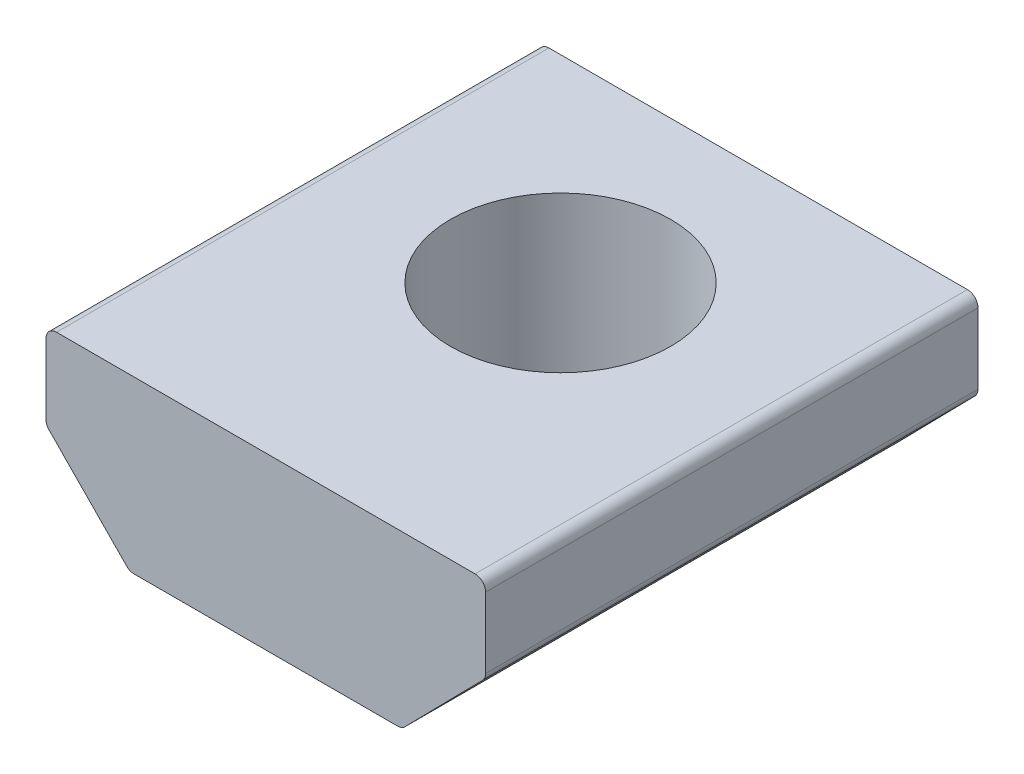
ISO-10303-21;
HEADER;
FILE_DESCRIPTION(('STEP AP214'),'2;1');
FILE_NAME('part.step','',(''),(''),'','','');
FILE_SCHEMA(('AUTOMOTIVE_DESIGN { 1 0 10303 214 1 1 1 1 }'));
ENDSEC;
DATA;
#1=APPLICATION_CONTEXT('core data for automotive mechanical design processes');
#2=APPLICATION_PROTOCOL_DEFINITION('international standard','automotive_design',2000,#1);
#3=PRODUCT_CONTEXT('',#1,'mechanical');
#4=PRODUCT('Part','Part','',(#3));
#5=PRODUCT_RELATED_PRODUCT_CATEGORY('part','',(#4));
#6=PRODUCT_DEFINITION_FORMATION('','',#4);
#7=PRODUCT_DEFINITION_CONTEXT('part definition',#1,'design');
#8=PRODUCT_DEFINITION('design','',#6,#7);
#9=PRODUCT_DEFINITION_SHAPE('','',#8);
#10=(LENGTH_UNIT() NAMED_UNIT(*) SI_UNIT(.MILLI.,.METRE.));
#11=(NAMED_UNIT(*) PLANE_ANGLE_UNIT() SI_UNIT($,.RADIAN.));
#12=(NAMED_UNIT(*) SI_UNIT($,.STERADIAN.) SOLID_ANGLE_UNIT());
#13=UNCERTAINTY_MEASURE_WITH_UNIT(LENGTH_MEASURE(1.E-05),#10,'distance_accuracy_value','');
#14=(GEOMETRIC_REPRESENTATION_CONTEXT(3) GLOBAL_UNCERTAINTY_ASSIGNED_CONTEXT((#13)) GLOBAL_UNIT_ASSIGNED_CONTEXT((#10,
#11,#12)) REPRESENTATION_CONTEXT('',''));
#15=CARTESIAN_POINT('',(0.,0.,0.));
#16=DIRECTION('',(0.,0.,1.));
#17=DIRECTION('',(1.,0.,0.));
#18=AXIS2_PLACEMENT_3D('',#15,#16,#17);
#19=CARTESIAN_POINT('',(-4.75499043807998,-5.77849999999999,17.78));
#20=DIRECTION('',(0.,0.,-1.));
#21=DIRECTION('',(-1.,0.,0.));
#22=AXIS2_PLACEMENT_3D('',#19,#20,#21);
#23=CYLINDRICAL_SURFACE('',#22,0.380999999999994);
#24=CARTESIAN_POINT('',(-4.75499043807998,-5.77849999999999,0.));
#25=DIRECTION('',(0.,0.,1.));
#26=DIRECTION('',(1.,0.,0.));
#27=AXIS2_PLACEMENT_3D('',#24,#25,#26);
#28=CIRCLE('',#27,0.380999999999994);
#29=CARTESIAN_POINT('',(-5.02690926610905,-6.04537291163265,0.));
#30=VERTEX_POINT('',#29);
#31=CARTESIAN_POINT('',(-4.75499043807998,-6.15949999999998,0.));
#32=VERTEX_POINT('',#31);
#33=EDGE_CURVE('E152',#30,#32,#28,.T.);
#34=ORIENTED_EDGE('',*,*,#33,.T.);
#35=DIRECTION('',(0.,0.,-1.));
#36=VECTOR('',#35,1.);
#37=CARTESIAN_POINT('',(-4.75499043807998,-6.15949999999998,17.78));
#38=LINE('',#37,#36);
#39=CARTESIAN_POINT('',(-4.75499043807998,-6.15949999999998,17.78));
#40=VERTEX_POINT('',#39);
#41=EDGE_CURVE('E11',#40,#32,#38,.T.);
#42=ORIENTED_EDGE('',*,*,#41,.F.);
#43=CARTESIAN_POINT('',(-4.75499043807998,-5.77849999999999,17.78));
#44=DIRECTION('',(0.,0.,1.));
#45=DIRECTION('',(1.,0.,0.));
#46=AXIS2_PLACEMENT_3D('',#43,#44,#45);
#47=CIRCLE('',#46,0.380999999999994);
#48=CARTESIAN_POINT('',(-5.02690926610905,-6.04537291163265,17.78));
#49=VERTEX_POINT('',#48);
#50=EDGE_CURVE('E175',#49,#40,#47,.T.);
#51=ORIENTED_EDGE('',*,*,#50,.F.);
#52=DIRECTION('',(0.,0.,-1.));
#53=VECTOR('',#52,1.);
#54=CARTESIAN_POINT('',(-5.02690926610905,-6.04537291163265,17.78));
#55=LINE('',#54,#53);
#56=EDGE_CURVE('E148',#49,#30,#55,.T.);
#57=ORIENTED_EDGE('',*,*,#56,.T.);
#58=EDGE_LOOP('',(#34,#42,#51,#57));
#59=FACE_BOUND('',#58,.T.);
#60=ADVANCED_FACE('F32',(#59),#23,.T.);
#61=CARTESIAN_POINT('',(-4.75499043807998,-6.15949999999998,17.78));
#62=DIRECTION('',(0.,1.,0.));
#63=DIRECTION('',(0.,0.,1.));
#64=AXIS2_PLACEMENT_3D('',#61,#62,#63);
#65=PLANE('',#64);
#66=CARTESIAN_POINT('',(0.,-6.15950000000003,7.1374));
#67=DIRECTION('',(0.,1.,0.));
#68=DIRECTION('',(-1.,0.,0.));
#69=AXIS2_PLACEMENT_3D('',#66,#67,#68);
#70=CIRCLE('',#69,3.97510000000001);
#71=CARTESIAN_POINT('',(-3.97509999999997,-6.15950000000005,7.1374));
#72=VERTEX_POINT('',#71);
#73=EDGE_CURVE('E156',#72,#72,#70,.T.);
#74=ORIENTED_EDGE('',*,*,#73,.T.);
#75=EDGE_LOOP('',(#74));
#76=FACE_BOUND('',#75,.T.);
#77=DIRECTION('',(1.,0.,0.));
#78=VECTOR('',#77,1.);
#79=CARTESIAN_POINT('',(-4.75499043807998,-6.15949999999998,0.));
#80=LINE('',#79,#78);
#81=CARTESIAN_POINT('',(4.75499043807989,-6.15949999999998,0.));
#82=VERTEX_POINT('',#81);
#83=EDGE_CURVE('E155',#32,#82,#80,.T.);
#84=ORIENTED_EDGE('',*,*,#83,.T.);
#85=DIRECTION('',(0.,0.,-1.));
#86=VECTOR('',#85,1.);
#87=CARTESIAN_POINT('',(4.75499043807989,-6.15949999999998,17.78));
#88=LINE('',#87,#86);
#89=CARTESIAN_POINT('',(4.75499043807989,-6.15949999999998,17.78));
#90=VERTEX_POINT('',#89);
#91=EDGE_CURVE('E40',#90,#82,#88,.T.);
#92=ORIENTED_EDGE('',*,*,#91,.F.);
#93=DIRECTION('',(1.,0.,0.));
#94=VECTOR('',#93,1.);
#95=CARTESIAN_POINT('',(-4.75499043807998,-6.15949999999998,17.78));
#96=LINE('',#95,#94);
#97=EDGE_CURVE('E103',#40,#90,#96,.T.);
#98=ORIENTED_EDGE('',*,*,#97,.F.);
#99=ORIENTED_EDGE('',*,*,#41,.T.);
#100=EDGE_LOOP('',(#84,#92,#98,#99));
#101=FACE_BOUND('',#100,.T.);
#102=ADVANCED_FACE('F253',(#76,#101),#65,.F.);
#103=CARTESIAN_POINT('',(4.75499043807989,-5.77849999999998,17.78));
#104=DIRECTION('',(0.,0.,-1.));
#105=DIRECTION('',(-1.,0.,0.));
#106=AXIS2_PLACEMENT_3D('',#103,#104,#105);
#107=CYLINDRICAL_SURFACE('',#106,0.381000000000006);
#108=CARTESIAN_POINT('',(4.75499043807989,-5.77849999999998,0.));
#109=DIRECTION('',(0.,0.,1.));
#110=DIRECTION('',(1.,0.,0.));
#111=AXIS2_PLACEMENT_3D('',#108,#109,#110);
#112=CIRCLE('',#111,0.381000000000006);
#113=CARTESIAN_POINT('',(5.02690926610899,-6.04537291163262,0.));
#114=VERTEX_POINT('',#113);
#115=EDGE_CURVE('E158',#82,#114,#112,.T.);
#116=ORIENTED_EDGE('',*,*,#115,.T.);
#117=DIRECTION('',(0.,0.,-1.));
#118=VECTOR('',#117,1.);
#119=CARTESIAN_POINT('',(5.02690926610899,-6.04537291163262,17.78));
#120=LINE('',#119,#118);
#121=CARTESIAN_POINT('',(5.02690926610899,-6.04537291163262,17.78));
#122=VERTEX_POINT('',#121);
#123=EDGE_CURVE('E194',#122,#114,#120,.T.);
#124=ORIENTED_EDGE('',*,*,#123,.F.);
#125=CARTESIAN_POINT('',(4.75499043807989,-5.77849999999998,17.78));
#126=DIRECTION('',(0.,0.,1.));
#127=DIRECTION('',(1.,0.,0.));
#128=AXIS2_PLACEMENT_3D('',#125,#126,#127);
#129=CIRCLE('',#128,0.381000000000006);
#130=EDGE_CURVE('E202',#90,#122,#129,.T.);
#131=ORIENTED_EDGE('',*,*,#130,.F.);
#132=ORIENTED_EDGE('',*,*,#91,.T.);
#133=EDGE_LOOP('',(#116,#124,#131,#132));
#134=FACE_BOUND('',#133,.T.);
#135=ADVANCED_FACE('F200',(#134),#107,.T.);
#136=CARTESIAN_POINT('',(5.02690926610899,-6.04537291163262,17.78));
#137=DIRECTION('',(-0.713697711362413,0.700453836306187,0.));
#138=DIRECTION('',(-0.700453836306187,-0.713697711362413,0.));
#139=AXIS2_PLACEMENT_3D('',#136,#137,#138);
#140=PLANE('',#139);
#141=DIRECTION('',(0.700453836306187,0.713697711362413,0.));
#142=VECTOR('',#141,1.);
#143=CARTESIAN_POINT('',(5.02690926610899,-6.04537291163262,0.));
#144=LINE('',#143,#142);
#145=CARTESIAN_POINT('',(7.82841882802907,-3.19089363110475,0.));
#146=VERTEX_POINT('',#145);
#147=EDGE_CURVE('E160',#114,#146,#144,.T.);
#148=ORIENTED_EDGE('',*,*,#147,.T.);
#149=DIRECTION('',(0.,0.,-1.));
#150=VECTOR('',#149,1.);
#151=CARTESIAN_POINT('',(7.82841882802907,-3.19089363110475,17.78));
#152=LINE('',#151,#150);
#153=CARTESIAN_POINT('',(7.82841882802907,-3.19089363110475,17.78));
#154=VERTEX_POINT('',#153);
#155=EDGE_CURVE('E191',#154,#146,#152,.T.);
#156=ORIENTED_EDGE('',*,*,#155,.F.);
#157=DIRECTION('',(0.700453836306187,0.713697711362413,0.));
#158=VECTOR('',#157,1.);
#159=CARTESIAN_POINT('',(5.02690926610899,-6.04537291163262,17.78));
#160=LINE('',#159,#158);
#161=EDGE_CURVE('E220',#122,#154,#160,.T.);
#162=ORIENTED_EDGE('',*,*,#161,.F.);
#163=ORIENTED_EDGE('',*,*,#123,.T.);
#164=EDGE_LOOP('',(#148,#156,#162,#163));
#165=FACE_BOUND('',#164,.T.);
#166=ADVANCED_FACE('F211',(#165),#140,.F.);
#167=CARTESIAN_POINT('',(7.55649999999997,-2.92402071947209,17.78));
#168=DIRECTION('',(0.,0.,-1.));
#169=DIRECTION('',(-1.,0.,0.));
#170=AXIS2_PLACEMENT_3D('',#167,#168,#169);
#171=CYLINDRICAL_SURFACE('',#170,0.381000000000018);
#172=CARTESIAN_POINT('',(7.55649999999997,-2.92402071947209,0.));
#173=DIRECTION('',(0.,0.,1.));
#174=DIRECTION('',(1.,0.,0.));
#175=AXIS2_PLACEMENT_3D('',#172,#173,#174);
#176=CIRCLE('',#175,0.381000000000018);
#177=CARTESIAN_POINT('',(7.93749999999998,-2.92402071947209,0.));
#178=VERTEX_POINT('',#177);
#179=EDGE_CURVE('E162',#146,#178,#176,.T.);
#180=ORIENTED_EDGE('',*,*,#179,.T.);
#181=DIRECTION('',(0.,0.,-1.));
#182=VECTOR('',#181,1.);
#183=CARTESIAN_POINT('',(7.93749999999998,-2.92402071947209,17.78));
#184=LINE('',#183,#182);
#185=CARTESIAN_POINT('',(7.93749999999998,-2.92402071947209,17.78));
#186=VERTEX_POINT('',#185);
#187=EDGE_CURVE('E188',#186,#178,#184,.T.);
#188=ORIENTED_EDGE('',*,*,#187,.F.);
#189=CARTESIAN_POINT('',(7.55649999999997,-2.92402071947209,17.78));
#190=DIRECTION('',(0.,0.,1.));
#191=DIRECTION('',(1.,0.,0.));
#192=AXIS2_PLACEMENT_3D('',#189,#190,#191);
#193=CIRCLE('',#192,0.381000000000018);
#194=EDGE_CURVE('E217',#154,#186,#193,.T.);
#195=ORIENTED_EDGE('',*,*,#194,.F.);
#196=ORIENTED_EDGE('',*,*,#155,.T.);
#197=EDGE_LOOP('',(#180,#188,#195,#196));
#198=FACE_BOUND('',#197,.T.);
#199=ADVANCED_FACE('F215',(#198),#171,.T.);
#200=CARTESIAN_POINT('',(7.93749999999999,-0.380999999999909,17.78));
#201=DIRECTION('',(-1.,0.,0.));
#202=DIRECTION('',(0.,0.,1.));
#203=AXIS2_PLACEMENT_3D('',#200,#201,#202);
#204=PLANE('',#203);
#205=DIRECTION('',(0.,1.,0.));
#206=VECTOR('',#205,1.);
#207=CARTESIAN_POINT('',(7.93749999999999,-0.380999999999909,0.));
#208=LINE('',#207,#206);
#209=CARTESIAN_POINT('',(7.93749999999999,-0.380999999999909,0.));
#210=VERTEX_POINT('',#209);
#211=EDGE_CURVE('E164',#178,#210,#208,.T.);
#212=ORIENTED_EDGE('',*,*,#211,.T.);
#213=DIRECTION('',(0.,0.,-1.));
#214=VECTOR('',#213,1.);
#215=CARTESIAN_POINT('',(7.93749999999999,-0.380999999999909,17.78));
#216=LINE('',#215,#214);
#217=CARTESIAN_POINT('',(7.93749999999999,-0.380999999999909,17.78));
#218=VERTEX_POINT('',#217);
#219=EDGE_CURVE('E185',#218,#210,#216,.T.);
#220=ORIENTED_EDGE('',*,*,#219,.F.);
#221=DIRECTION('',(0.,1.,0.));
#222=VECTOR('',#221,1.);
#223=CARTESIAN_POINT('',(7.93749999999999,-0.380999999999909,17.78));
#224=LINE('',#223,#222);
#225=EDGE_CURVE('E219',#186,#218,#224,.T.);
#226=ORIENTED_EDGE('',*,*,#225,.F.);
#227=ORIENTED_EDGE('',*,*,#187,.T.);
#228=EDGE_LOOP('',(#212,#220,#226,#227));
#229=FACE_BOUND('',#228,.T.);
#230=ADVANCED_FACE('F268',(#229),#204,.F.);
#231=CARTESIAN_POINT('',(7.55649999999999,-0.380999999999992,17.78));
#232=DIRECTION('',(0.,0.,-1.));
#233=DIRECTION('',(-1.,0.,0.));
#234=AXIS2_PLACEMENT_3D('',#231,#232,#233);
#235=CYLINDRICAL_SURFACE('',#234,0.380999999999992);
#236=CARTESIAN_POINT('',(7.55649999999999,-0.380999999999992,0.));
#237=DIRECTION('',(0.,0.,1.));
#238=DIRECTION('',(1.,0.,0.));
#239=AXIS2_PLACEMENT_3D('',#236,#237,#238);
#240=CIRCLE('',#239,0.380999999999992);
#241=CARTESIAN_POINT('',(7.55649999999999,0.,0.));
#242=VERTEX_POINT('',#241);
#243=EDGE_CURVE('E166',#210,#242,#240,.T.);
#244=ORIENTED_EDGE('',*,*,#243,.T.);
#245=DIRECTION('',(0.,0.,-1.));
#246=VECTOR('',#245,1.);
#247=CARTESIAN_POINT('',(7.55649999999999,0.,17.78));
#248=LINE('',#247,#246);
#249=CARTESIAN_POINT('',(7.55649999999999,0.,17.78));
#250=VERTEX_POINT('',#249);
#251=EDGE_CURVE('E182',#250,#242,#248,.T.);
#252=ORIENTED_EDGE('',*,*,#251,.F.);
#253=CARTESIAN_POINT('',(7.55649999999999,-0.380999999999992,17.78));
#254=DIRECTION('',(0.,0.,1.));
#255=DIRECTION('',(1.,0.,0.));
#256=AXIS2_PLACEMENT_3D('',#253,#254,#255);
#257=CIRCLE('',#256,0.380999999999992);
#258=EDGE_CURVE('E222',#218,#250,#257,.T.);
#259=ORIENTED_EDGE('',*,*,#258,.F.);
#260=ORIENTED_EDGE('',*,*,#219,.T.);
#261=EDGE_LOOP('',(#244,#252,#259,#260));
#262=FACE_BOUND('',#261,.T.);
#263=ADVANCED_FACE('F271',(#262),#235,.T.);
#264=CARTESIAN_POINT('',(-7.55649999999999,0.,17.78));
#265=DIRECTION('',(0.,-1.,0.));
#266=DIRECTION('',(0.,0.,-1.));
#267=AXIS2_PLACEMENT_3D('',#264,#265,#266);
#268=PLANE('',#267);
#269=CARTESIAN_POINT('',(0.,0.,7.1374));
#270=DIRECTION('',(0.,1.,0.));
#271=DIRECTION('',(-1.,0.,0.));
#272=AXIS2_PLACEMENT_3D('',#269,#270,#271);
#273=CIRCLE('',#272,3.97510000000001);
#274=CARTESIAN_POINT('',(-3.97510000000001,0.,7.1374));
#275=VERTEX_POINT('',#274);
#276=EDGE_CURVE('E339',#275,#275,#273,.T.);
#277=ORIENTED_EDGE('',*,*,#276,.F.);
#278=EDGE_LOOP('',(#277));
#279=FACE_BOUND('',#278,.T.);
#280=DIRECTION('',(-1.,0.,0.));
#281=VECTOR('',#280,1.);
#282=CARTESIAN_POINT('',(-7.55649999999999,0.,0.));
#283=LINE('',#282,#281);
#284=CARTESIAN_POINT('',(-7.55649999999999,0.,0.));
#285=VERTEX_POINT('',#284);
#286=EDGE_CURVE('E168',#242,#285,#283,.T.);
#287=ORIENTED_EDGE('',*,*,#286,.T.);
#288=DIRECTION('',(0.,0.,-1.));
#289=VECTOR('',#288,1.);
#290=CARTESIAN_POINT('',(-7.55649999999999,0.,17.78));
#291=LINE('',#290,#289);
#292=CARTESIAN_POINT('',(-7.55649999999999,0.,17.78));
#293=VERTEX_POINT('',#292);
#294=EDGE_CURVE('E179',#293,#285,#291,.T.);
#295=ORIENTED_EDGE('',*,*,#294,.F.);
#296=DIRECTION('',(-1.,0.,0.));
#297=VECTOR('',#296,1.);
#298=CARTESIAN_POINT('',(-7.55649999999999,0.,17.78));
#299=LINE('',#298,#297);
#300=EDGE_CURVE('E228',#250,#293,#299,.T.);
#301=ORIENTED_EDGE('',*,*,#300,.F.);
#302=ORIENTED_EDGE('',*,*,#251,.T.);
#303=EDGE_LOOP('',(#287,#295,#301,#302));
#304=FACE_BOUND('',#303,.T.);
#305=ADVANCED_FACE('F234',(#279,#304),#268,.F.);
#306=CARTESIAN_POINT('',(-7.55649999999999,-0.380999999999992,17.78));
#307=DIRECTION('',(0.,0.,-1.));
#308=DIRECTION('',(-1.,0.,0.));
#309=AXIS2_PLACEMENT_3D('',#306,#307,#308);
#310=CYLINDRICAL_SURFACE('',#309,0.380999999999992);
#311=CARTESIAN_POINT('',(-7.55649999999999,-0.380999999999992,0.));
#312=DIRECTION('',(0.,0.,1.));
#313=DIRECTION('',(1.,0.,0.));
#314=AXIS2_PLACEMENT_3D('',#311,#312,#313);
#315=CIRCLE('',#314,0.380999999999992);
#316=CARTESIAN_POINT('',(-7.93749999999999,-0.380999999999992,0.));
#317=VERTEX_POINT('',#316);
#318=EDGE_CURVE('E170',#285,#317,#315,.T.);
#319=ORIENTED_EDGE('',*,*,#318,.T.);
#320=DIRECTION('',(0.,0.,-1.));
#321=VECTOR('',#320,1.);
#322=CARTESIAN_POINT('',(-7.93749999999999,-0.380999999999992,17.78));
#323=LINE('',#322,#321);
#324=CARTESIAN_POINT('',(-7.93749999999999,-0.380999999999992,17.78));
#325=VERTEX_POINT('',#324);
#326=EDGE_CURVE('E143',#325,#317,#323,.T.);
#327=ORIENTED_EDGE('',*,*,#326,.F.);
#328=CARTESIAN_POINT('',(-7.55649999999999,-0.380999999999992,17.78));
#329=DIRECTION('',(0.,0.,1.));
#330=DIRECTION('',(1.,0.,0.));
#331=AXIS2_PLACEMENT_3D('',#328,#329,#330);
#332=CIRCLE('',#331,0.380999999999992);
#333=EDGE_CURVE('E134',#293,#325,#332,.T.);
#334=ORIENTED_EDGE('',*,*,#333,.F.);
#335=ORIENTED_EDGE('',*,*,#294,.T.);
#336=EDGE_LOOP('',(#319,#327,#334,#335));
#337=FACE_BOUND('',#336,.T.);
#338=ADVANCED_FACE('F238',(#337),#310,.T.);
#339=CARTESIAN_POINT('',(-7.93749999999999,-0.380999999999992,17.78));
#340=DIRECTION('',(1.,0.,0.));
#341=DIRECTION('',(0.,0.,-1.));
#342=AXIS2_PLACEMENT_3D('',#339,#340,#341);
#343=PLANE('',#342);
#344=DIRECTION('',(0.,-1.,0.));
#345=VECTOR('',#344,1.);
#346=CARTESIAN_POINT('',(-7.93749999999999,-0.380999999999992,0.));
#347=LINE('',#346,#345);
#348=CARTESIAN_POINT('',(-7.93749999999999,-2.9240207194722,0.));
#349=VERTEX_POINT('',#348);
#350=EDGE_CURVE('E142',#317,#349,#347,.T.);
#351=ORIENTED_EDGE('',*,*,#350,.T.);
#352=DIRECTION('',(0.,0.,-1.));
#353=VECTOR('',#352,1.);
#354=CARTESIAN_POINT('',(-7.93749999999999,-2.9240207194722,17.78));
#355=LINE('',#354,#353);
#356=CARTESIAN_POINT('',(-7.93749999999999,-2.9240207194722,17.78));
#357=VERTEX_POINT('',#356);
#358=EDGE_CURVE('E139',#357,#349,#355,.T.);
#359=ORIENTED_EDGE('',*,*,#358,.F.);
#360=DIRECTION('',(0.,-1.,0.));
#361=VECTOR('',#360,1.);
#362=CARTESIAN_POINT('',(-7.93749999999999,-0.380999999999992,17.78));
#363=LINE('',#362,#361);
#364=EDGE_CURVE('E128',#325,#357,#363,.T.);
#365=ORIENTED_EDGE('',*,*,#364,.F.);
#366=ORIENTED_EDGE('',*,*,#326,.T.);
#367=EDGE_LOOP('',(#351,#359,#365,#366));
#368=FACE_BOUND('',#367,.T.);
#369=ADVANCED_FACE('F140',(#368),#343,.F.);
#370=CARTESIAN_POINT('',(-7.55649999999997,-2.9240207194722,17.78));
#371=DIRECTION('',(0.,0.,-1.));
#372=DIRECTION('',(-1.,0.,0.));
#373=AXIS2_PLACEMENT_3D('',#370,#371,#372);
#374=CYLINDRICAL_SURFACE('',#373,0.381000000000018);
#375=CARTESIAN_POINT('',(-7.55649999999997,-2.9240207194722,0.));
#376=DIRECTION('',(0.,0.,1.));
#377=DIRECTION('',(1.,0.,0.));
#378=AXIS2_PLACEMENT_3D('',#375,#376,#377);
#379=CIRCLE('',#378,0.381000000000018);
#380=CARTESIAN_POINT('',(-7.82841882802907,-3.19089363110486,0.));
#381=VERTEX_POINT('',#380);
#382=EDGE_CURVE('E89',#349,#381,#379,.T.);
#383=ORIENTED_EDGE('',*,*,#382,.T.);
#384=DIRECTION('',(0.,0.,-1.));
#385=VECTOR('',#384,1.);
#386=CARTESIAN_POINT('',(-7.82841882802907,-3.19089363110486,17.78));
#387=LINE('',#386,#385);
#388=CARTESIAN_POINT('',(-7.82841882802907,-3.19089363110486,17.78));
#389=VERTEX_POINT('',#388);
#390=EDGE_CURVE('E144',#389,#381,#387,.T.);
#391=ORIENTED_EDGE('',*,*,#390,.F.);
#392=CARTESIAN_POINT('',(-7.55649999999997,-2.9240207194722,17.78));
#393=DIRECTION('',(0.,0.,1.));
#394=DIRECTION('',(1.,0.,0.));
#395=AXIS2_PLACEMENT_3D('',#392,#393,#394);
#396=CIRCLE('',#395,0.381000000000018);
#397=EDGE_CURVE('E132',#357,#389,#396,.T.);
#398=ORIENTED_EDGE('',*,*,#397,.F.);
#399=ORIENTED_EDGE('',*,*,#358,.T.);
#400=EDGE_LOOP('',(#383,#391,#398,#399));
#401=FACE_BOUND('',#400,.T.);
#402=ADVANCED_FACE('F146',(#401),#374,.T.);
#403=CARTESIAN_POINT('',(-7.82841882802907,-3.19089363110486,17.78));
#404=DIRECTION('',(0.713697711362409,0.70045383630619,0.));
#405=DIRECTION('',(-0.70045383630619,0.713697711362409,0.));
#406=AXIS2_PLACEMENT_3D('',#403,#404,#405);
#407=PLANE('',#406);
#408=DIRECTION('',(0.70045383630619,-0.713697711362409,0.));
#409=VECTOR('',#408,1.);
#410=CARTESIAN_POINT('',(-7.82841882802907,-3.19089363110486,0.));
#411=LINE('',#410,#409);
#412=EDGE_CURVE('E95',#381,#30,#411,.T.);
#413=ORIENTED_EDGE('',*,*,#412,.T.);
#414=ORIENTED_EDGE('',*,*,#56,.F.);
#415=DIRECTION('',(0.70045383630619,-0.713697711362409,0.));
#416=VECTOR('',#415,1.);
#417=CARTESIAN_POINT('',(-7.82841882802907,-3.19089363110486,17.78));
#418=LINE('',#417,#416);
#419=EDGE_CURVE('E48',#389,#49,#418,.T.);
#420=ORIENTED_EDGE('',*,*,#419,.F.);
#421=ORIENTED_EDGE('',*,*,#390,.T.);
#422=EDGE_LOOP('',(#413,#414,#420,#421));
#423=FACE_BOUND('',#422,.T.);
#424=ADVANCED_FACE('F242',(#423),#407,.F.);
#425=CARTESIAN_POINT('',(-4.75499043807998,-5.77849999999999,17.78));
#426=DIRECTION('',(0.,0.,1.));
#427=DIRECTION('',(1.,0.,0.));
#428=AXIS2_PLACEMENT_3D('',#425,#426,#427);
#429=PLANE('',#428);
#430=ORIENTED_EDGE('',*,*,#50,.T.);
#431=ORIENTED_EDGE('',*,*,#97,.T.);
#432=ORIENTED_EDGE('',*,*,#130,.T.);
#433=ORIENTED_EDGE('',*,*,#161,.T.);
#434=ORIENTED_EDGE('',*,*,#194,.T.);
#435=ORIENTED_EDGE('',*,*,#225,.T.);
#436=ORIENTED_EDGE('',*,*,#258,.T.);
#437=ORIENTED_EDGE('',*,*,#300,.T.);
#438=ORIENTED_EDGE('',*,*,#333,.T.);
#439=ORIENTED_EDGE('',*,*,#364,.T.);
#440=ORIENTED_EDGE('',*,*,#397,.T.);
#441=ORIENTED_EDGE('',*,*,#419,.T.);
#442=EDGE_LOOP('',(#430,#431,#432,#433,#434,#435,#436,#437,#438,#439,#440,#441));
#443=FACE_BOUND('',#442,.T.);
#444=ADVANCED_FACE('F130',(#443),#429,.T.);
#445=CARTESIAN_POINT('',(-4.75499043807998,-5.77849999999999,0.));
#446=DIRECTION('',(0.,0.,1.));
#447=DIRECTION('',(1.,0.,0.));
#448=AXIS2_PLACEMENT_3D('',#445,#446,#447);
#449=PLANE('',#448);
#450=ORIENTED_EDGE('',*,*,#33,.F.);
#451=ORIENTED_EDGE('',*,*,#412,.F.);
#452=ORIENTED_EDGE('',*,*,#382,.F.);
#453=ORIENTED_EDGE('',*,*,#350,.F.);
#454=ORIENTED_EDGE('',*,*,#318,.F.);
#455=ORIENTED_EDGE('',*,*,#286,.F.);
#456=ORIENTED_EDGE('',*,*,#243,.F.);
#457=ORIENTED_EDGE('',*,*,#211,.F.);
#458=ORIENTED_EDGE('',*,*,#179,.F.);
#459=ORIENTED_EDGE('',*,*,#147,.F.);
#460=ORIENTED_EDGE('',*,*,#115,.F.);
#461=ORIENTED_EDGE('',*,*,#83,.F.);
#462=EDGE_LOOP('',(#450,#451,#452,#453,#454,#455,#456,#457,#458,#459,#460,#461));
#463=FACE_BOUND('',#462,.T.);
#464=ADVANCED_FACE('F206',(#463),#449,.F.);
#465=CARTESIAN_POINT('',(0.,-6.15950000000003,7.1374));
#466=DIRECTION('',(0.,1.,0.));
#467=DIRECTION('',(-1.,0.,0.));
#468=AXIS2_PLACEMENT_3D('',#465,#466,#467);
#469=CYLINDRICAL_SURFACE('',#468,3.97510000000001);
#470=ORIENTED_EDGE('',*,*,#73,.F.);
#471=EDGE_LOOP('',(#470));
#472=FACE_BOUND('',#471,.T.);
#473=ORIENTED_EDGE('',*,*,#276,.T.);
#474=EDGE_LOOP('',(#473));
#475=FACE_BOUND('',#474,.T.);
#476=ADVANCED_FACE('F308',(#472,#475),#469,.F.);
#477=CLOSED_SHELL('',(#60,#102,#135,#166,#199,#230,#263,#305,#338,#369,#402,#424,#444,#464,#476));
#478=MANIFOLD_SOLID_BREP('B2',#477);
#479=ADVANCED_BREP_SHAPE_REPRESENTATION('',(#18,#478),#14);
#480=SHAPE_DEFINITION_REPRESENTATION(#9,#479);
ENDSEC;
END-ISO-10303-21;
